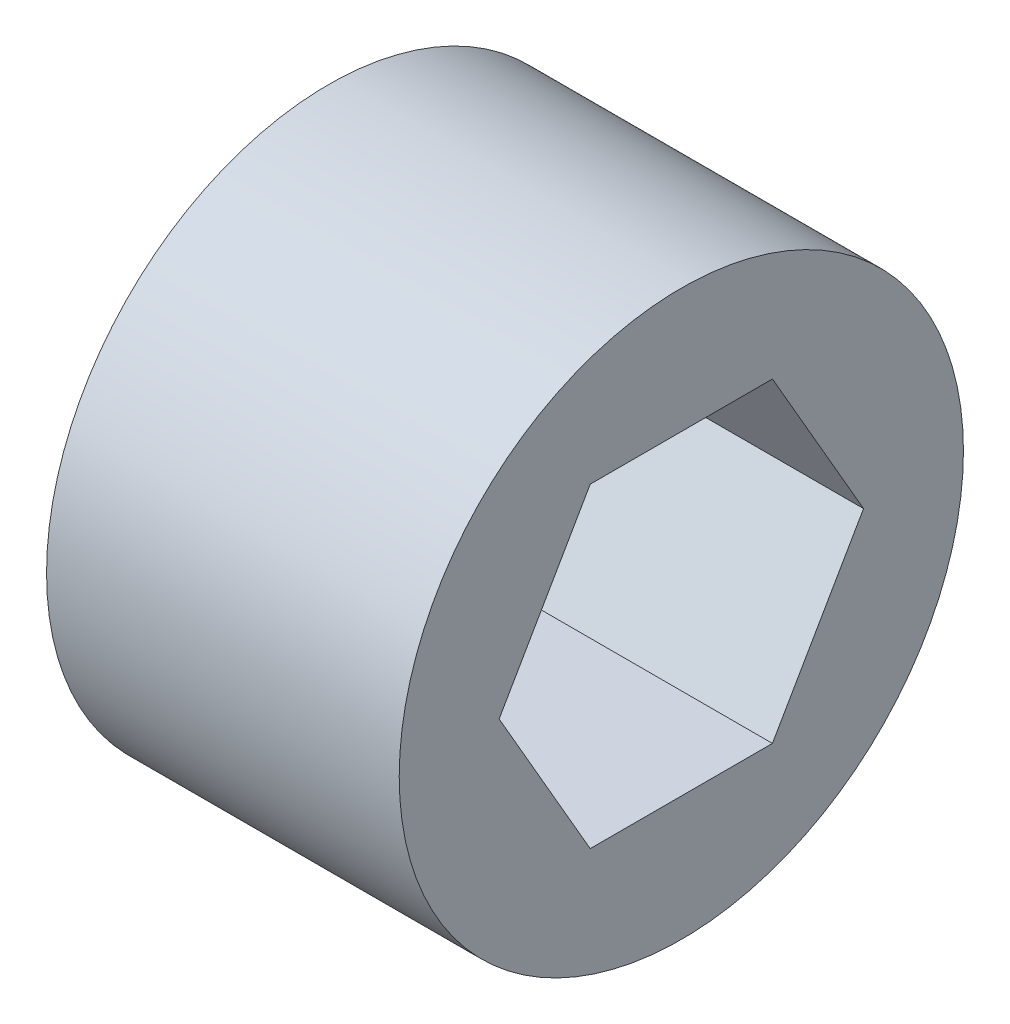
ISO-10303-21;
HEADER;
FILE_DESCRIPTION(('STEP AP214'),'2;1');
FILE_NAME('part.step','',(''),(''),'','','');
FILE_SCHEMA(('AUTOMOTIVE_DESIGN { 1 0 10303 214 1 1 1 1 }'));
ENDSEC;
DATA;
#1=APPLICATION_CONTEXT('core data for automotive mechanical design processes');
#2=APPLICATION_PROTOCOL_DEFINITION('international standard','automotive_design',2000,#1);
#3=PRODUCT_CONTEXT('',#1,'mechanical');
#4=PRODUCT('Part','Part','',(#3));
#5=PRODUCT_RELATED_PRODUCT_CATEGORY('part','',(#4));
#6=PRODUCT_DEFINITION_FORMATION('','',#4);
#7=PRODUCT_DEFINITION_CONTEXT('part definition',#1,'design');
#8=PRODUCT_DEFINITION('design','',#6,#7);
#9=PRODUCT_DEFINITION_SHAPE('','',#8);
#10=(LENGTH_UNIT() NAMED_UNIT(*) SI_UNIT(.MILLI.,.METRE.));
#11=(NAMED_UNIT(*) PLANE_ANGLE_UNIT() SI_UNIT($,.RADIAN.));
#12=(NAMED_UNIT(*) SI_UNIT($,.STERADIAN.) SOLID_ANGLE_UNIT());
#13=UNCERTAINTY_MEASURE_WITH_UNIT(LENGTH_MEASURE(1.E-05),#10,'distance_accuracy_value','');
#14=(GEOMETRIC_REPRESENTATION_CONTEXT(3) GLOBAL_UNCERTAINTY_ASSIGNED_CONTEXT((#13)) GLOBAL_UNIT_ASSIGNED_CONTEXT((#10,
#11,#12)) REPRESENTATION_CONTEXT('',''));
#15=CARTESIAN_POINT('',(0.,0.,0.));
#16=DIRECTION('',(0.,0.,1.));
#17=DIRECTION('',(1.,0.,0.));
#18=AXIS2_PLACEMENT_3D('',#15,#16,#17);
#19=CARTESIAN_POINT('',(43.895,10.675,6.85639999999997));
#20=DIRECTION('',(-1.,0.,0.));
#21=DIRECTION('',(0.,0.,1.));
#22=AXIS2_PLACEMENT_3D('',#19,#20,#21);
#23=PLANE('',#22);
#24=DIRECTION('',(0.,-0.866025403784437,0.500000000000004));
#25=VECTOR('',#24,1.);
#26=CARTESIAN_POINT('',(43.895,12.3797710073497,7.84064999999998));
#27=LINE('',#26,#25);
#28=CARTESIAN_POINT('',(43.895,12.3797710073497,7.84064999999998));
#29=VERTEX_POINT('',#28);
#30=CARTESIAN_POINT('',(43.895,10.675,8.82489999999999));
#31=VERTEX_POINT('',#30);
#32=EDGE_CURVE('E72',#29,#31,#27,.T.);
#33=ORIENTED_EDGE('',*,*,#32,.T.);
#34=DIRECTION('',(0.,-0.866025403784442,-0.499999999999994));
#35=VECTOR('',#34,1.);
#36=CARTESIAN_POINT('',(43.895,10.675,8.82489999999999));
#37=LINE('',#36,#35);
#38=CARTESIAN_POINT('',(43.895,8.97022899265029,7.84064999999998));
#39=VERTEX_POINT('',#38);
#40=EDGE_CURVE('E75',#31,#39,#37,.T.);
#41=ORIENTED_EDGE('',*,*,#40,.T.);
#42=DIRECTION('',(0.,0.,-1.));
#43=VECTOR('',#42,1.);
#44=CARTESIAN_POINT('',(43.895,8.97022899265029,7.84064999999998));
#45=LINE('',#44,#43);
#46=CARTESIAN_POINT('',(43.895,8.97022899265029,5.87214999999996));
#47=VERTEX_POINT('',#46);
#48=EDGE_CURVE('E93',#39,#47,#45,.T.);
#49=ORIENTED_EDGE('',*,*,#48,.T.);
#50=DIRECTION('',(0.,0.866025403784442,-0.499999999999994));
#51=VECTOR('',#50,1.);
#52=CARTESIAN_POINT('',(43.895,8.97022899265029,5.87214999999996));
#53=LINE('',#52,#51);
#54=CARTESIAN_POINT('',(43.895,10.675,4.88789999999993));
#55=VERTEX_POINT('',#54);
#56=EDGE_CURVE('E98',#47,#55,#53,.T.);
#57=ORIENTED_EDGE('',*,*,#56,.T.);
#58=DIRECTION('',(0.,0.866025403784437,0.500000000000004));
#59=VECTOR('',#58,1.);
#60=CARTESIAN_POINT('',(43.895,10.675,4.88789999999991));
#61=LINE('',#60,#59);
#62=CARTESIAN_POINT('',(43.895,12.3797710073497,5.87214999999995));
#63=VERTEX_POINT('',#62);
#64=EDGE_CURVE('E60',#55,#63,#61,.T.);
#65=ORIENTED_EDGE('',*,*,#64,.T.);
#66=DIRECTION('',(0.,0.,1.));
#67=VECTOR('',#66,1.);
#68=CARTESIAN_POINT('',(43.895,12.3797710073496,5.87214999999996));
#69=LINE('',#68,#67);
#70=EDGE_CURVE('E78',#63,#29,#69,.T.);
#71=ORIENTED_EDGE('',*,*,#70,.T.);
#72=EDGE_LOOP('',(#33,#41,#49,#57,#65,#71));
#73=FACE_BOUND('',#72,.T.);
#74=ADVANCED_FACE('F16',(#73),#23,.F.);
#75=CARTESIAN_POINT('',(46.435,12.3797710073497,7.84064999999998));
#76=DIRECTION('',(0.,0.500000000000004,0.866025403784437));
#77=DIRECTION('',(0.,-0.866025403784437,0.500000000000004));
#78=AXIS2_PLACEMENT_3D('',#75,#76,#77);
#79=PLANE('',#78);
#80=DIRECTION('',(1.,0.,0.));
#81=VECTOR('',#80,1.);
#82=CARTESIAN_POINT('',(46.435,12.3797710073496,7.84064999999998));
#83=LINE('',#82,#81);
#84=CARTESIAN_POINT('',(46.435,12.3797710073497,7.84064999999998));
#85=VERTEX_POINT('',#84);
#86=EDGE_CURVE('E53',#29,#85,#83,.T.);
#87=ORIENTED_EDGE('',*,*,#86,.T.);
#88=DIRECTION('',(0.,-0.86602540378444,0.499999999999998));
#89=VECTOR('',#88,1.);
#90=CARTESIAN_POINT('',(46.435,12.3797710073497,7.84064999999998));
#91=LINE('',#90,#89);
#92=CARTESIAN_POINT('',(46.435,10.675,8.82489999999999));
#93=VERTEX_POINT('',#92);
#94=EDGE_CURVE('E84',#85,#93,#91,.T.);
#95=ORIENTED_EDGE('',*,*,#94,.T.);
#96=DIRECTION('',(1.,0.,0.));
#97=VECTOR('',#96,1.);
#98=CARTESIAN_POINT('',(46.435,10.675,8.82489999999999));
#99=LINE('',#98,#97);
#100=EDGE_CURVE('E79',#93,#31,#99,.F.);
#101=ORIENTED_EDGE('',*,*,#100,.T.);
#102=ORIENTED_EDGE('',*,*,#32,.F.);
#103=EDGE_LOOP('',(#87,#95,#101,#102));
#104=FACE_BOUND('',#103,.T.);
#105=ADVANCED_FACE('F82',(#104),#79,.F.);
#106=CARTESIAN_POINT('',(46.435,10.675,8.82489999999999));
#107=DIRECTION('',(0.,-0.499999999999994,0.866025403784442));
#108=DIRECTION('',(0.,-0.866025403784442,-0.499999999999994));
#109=AXIS2_PLACEMENT_3D('',#106,#107,#108);
#110=PLANE('',#109);
#111=ORIENTED_EDGE('',*,*,#100,.F.);
#112=DIRECTION('',(0.,-0.86602540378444,-0.499999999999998));
#113=VECTOR('',#112,1.);
#114=CARTESIAN_POINT('',(46.435,10.675,8.82489999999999));
#115=LINE('',#114,#113);
#116=CARTESIAN_POINT('',(46.435,8.97022899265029,7.84064999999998));
#117=VERTEX_POINT('',#116);
#118=EDGE_CURVE('E117',#93,#117,#115,.T.);
#119=ORIENTED_EDGE('',*,*,#118,.T.);
#120=DIRECTION('',(1.,0.,0.));
#121=VECTOR('',#120,1.);
#122=CARTESIAN_POINT('',(46.435,8.97022899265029,7.84064999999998));
#123=LINE('',#122,#121);
#124=EDGE_CURVE('E90',#117,#39,#123,.F.);
#125=ORIENTED_EDGE('',*,*,#124,.T.);
#126=ORIENTED_EDGE('',*,*,#40,.F.);
#127=EDGE_LOOP('',(#111,#119,#125,#126));
#128=FACE_BOUND('',#127,.T.);
#129=ADVANCED_FACE('F88',(#128),#110,.F.);
#130=CARTESIAN_POINT('',(46.435,8.97022899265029,7.84064999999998));
#131=DIRECTION('',(0.,-1.,0.));
#132=DIRECTION('',(0.,0.,-1.));
#133=AXIS2_PLACEMENT_3D('',#130,#131,#132);
#134=PLANE('',#133);
#135=ORIENTED_EDGE('',*,*,#124,.F.);
#136=DIRECTION('',(0.,0.,1.));
#137=VECTOR('',#136,1.);
#138=CARTESIAN_POINT('',(46.435,8.97022899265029,6.85639999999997));
#139=LINE('',#138,#137);
#140=CARTESIAN_POINT('',(46.435,8.97022899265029,5.87214999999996));
#141=VERTEX_POINT('',#140);
#142=EDGE_CURVE('E115',#117,#141,#139,.F.);
#143=ORIENTED_EDGE('',*,*,#142,.T.);
#144=DIRECTION('',(1.,0.,0.));
#145=VECTOR('',#144,1.);
#146=CARTESIAN_POINT('',(46.435,8.97022899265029,5.87214999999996));
#147=LINE('',#146,#145);
#148=EDGE_CURVE('E96',#141,#47,#147,.F.);
#149=ORIENTED_EDGE('',*,*,#148,.T.);
#150=ORIENTED_EDGE('',*,*,#48,.F.);
#151=EDGE_LOOP('',(#135,#143,#149,#150));
#152=FACE_BOUND('',#151,.T.);
#153=ADVANCED_FACE('F122',(#152),#134,.F.);
#154=CARTESIAN_POINT('',(46.435,8.97022899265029,5.87214999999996));
#155=DIRECTION('',(0.,-0.499999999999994,-0.866025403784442));
#156=DIRECTION('',(0.,0.866025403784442,-0.499999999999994));
#157=AXIS2_PLACEMENT_3D('',#154,#155,#156);
#158=PLANE('',#157);
#159=ORIENTED_EDGE('',*,*,#148,.F.);
#160=DIRECTION('',(0.,0.86602540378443,-0.500000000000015));
#161=VECTOR('',#160,1.);
#162=CARTESIAN_POINT('',(46.435,8.97022899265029,5.87214999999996));
#163=LINE('',#162,#161);
#164=CARTESIAN_POINT('',(46.435,10.675,4.88789999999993));
#165=VERTEX_POINT('',#164);
#166=EDGE_CURVE('E113',#141,#165,#163,.T.);
#167=ORIENTED_EDGE('',*,*,#166,.T.);
#168=DIRECTION('',(1.,0.,0.));
#169=VECTOR('',#168,1.);
#170=CARTESIAN_POINT('',(46.435,10.675,4.88789999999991));
#171=LINE('',#170,#169);
#172=EDGE_CURVE('E100',#165,#55,#171,.F.);
#173=ORIENTED_EDGE('',*,*,#172,.T.);
#174=ORIENTED_EDGE('',*,*,#56,.F.);
#175=EDGE_LOOP('',(#159,#167,#173,#174));
#176=FACE_BOUND('',#175,.T.);
#177=ADVANCED_FACE('F129',(#176),#158,.F.);
#178=CARTESIAN_POINT('',(46.435,10.675,4.88789999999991));
#179=DIRECTION('',(0.,0.500000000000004,-0.866025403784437));
#180=DIRECTION('',(0.,0.866025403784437,0.500000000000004));
#181=AXIS2_PLACEMENT_3D('',#178,#179,#180);
#182=PLANE('',#181);
#183=ORIENTED_EDGE('',*,*,#172,.F.);
#184=DIRECTION('',(0.,0.866025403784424,0.500000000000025));
#185=VECTOR('',#184,1.);
#186=CARTESIAN_POINT('',(46.435,10.675,4.88789999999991));
#187=LINE('',#186,#185);
#188=CARTESIAN_POINT('',(46.435,12.3797710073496,5.87214999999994));
#189=VERTEX_POINT('',#188);
#190=EDGE_CURVE('E33',#165,#189,#187,.T.);
#191=ORIENTED_EDGE('',*,*,#190,.T.);
#192=DIRECTION('',(1.,0.,0.));
#193=VECTOR('',#192,1.);
#194=CARTESIAN_POINT('',(46.435,12.3797710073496,5.87214999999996));
#195=LINE('',#194,#193);
#196=EDGE_CURVE('E107',#189,#63,#195,.F.);
#197=ORIENTED_EDGE('',*,*,#196,.T.);
#198=ORIENTED_EDGE('',*,*,#64,.F.);
#199=EDGE_LOOP('',(#183,#191,#197,#198));
#200=FACE_BOUND('',#199,.T.);
#201=ADVANCED_FACE('F131',(#200),#182,.F.);
#202=CARTESIAN_POINT('',(46.435,12.3797710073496,5.87214999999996));
#203=DIRECTION('',(0.,1.,0.));
#204=DIRECTION('',(0.,0.,1.));
#205=AXIS2_PLACEMENT_3D('',#202,#203,#204);
#206=PLANE('',#205);
#207=ORIENTED_EDGE('',*,*,#196,.F.);
#208=DIRECTION('',(0.,0.,1.));
#209=VECTOR('',#208,1.);
#210=CARTESIAN_POINT('',(46.435,12.3797710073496,6.85639999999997));
#211=LINE('',#210,#209);
#212=EDGE_CURVE('E110',#189,#85,#211,.T.);
#213=ORIENTED_EDGE('',*,*,#212,.T.);
#214=ORIENTED_EDGE('',*,*,#86,.F.);
#215=ORIENTED_EDGE('',*,*,#70,.F.);
#216=EDGE_LOOP('',(#207,#213,#214,#215));
#217=FACE_BOUND('',#216,.T.);
#218=ADVANCED_FACE('F133',(#217),#206,.F.);
#219=CARTESIAN_POINT('',(46.435,10.9520909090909,6.85639999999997));
#220=DIRECTION('',(-1.,0.,0.));
#221=DIRECTION('',(0.,0.,1.));
#222=AXIS2_PLACEMENT_3D('',#219,#220,#221);
#223=PLANE('',#222);
#224=ORIENTED_EDGE('',*,*,#190,.F.);
#225=ORIENTED_EDGE('',*,*,#166,.F.);
#226=ORIENTED_EDGE('',*,*,#142,.F.);
#227=ORIENTED_EDGE('',*,*,#118,.F.);
#228=ORIENTED_EDGE('',*,*,#94,.F.);
#229=ORIENTED_EDGE('',*,*,#212,.F.);
#230=EDGE_LOOP('',(#224,#225,#226,#227,#228,#229));
#231=FACE_BOUND('',#230,.T.);
#232=CARTESIAN_POINT('',(46.435,10.675,6.85639999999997));
#233=DIRECTION('',(-1.,0.,0.));
#234=DIRECTION('',(0.,0.,1.));
#235=AXIS2_PLACEMENT_3D('',#232,#233,#234);
#236=CIRCLE('',#235,3.048);
#237=CARTESIAN_POINT('',(46.435,10.675,9.90439999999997));
#238=VERTEX_POINT('',#237);
#239=EDGE_CURVE('E20',#238,#238,#236,.T.);
#240=ORIENTED_EDGE('',*,*,#239,.F.);
#241=EDGE_LOOP('',(#240));
#242=FACE_BOUND('',#241,.T.);
#243=ADVANCED_FACE('F125',(#231,#242),#223,.F.);
#244=CARTESIAN_POINT('',(42.625,10.9520909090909,6.85639999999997));
#245=DIRECTION('',(-1.,0.,0.));
#246=DIRECTION('',(0.,0.,1.));
#247=AXIS2_PLACEMENT_3D('',#244,#245,#246);
#248=PLANE('',#247);
#249=CARTESIAN_POINT('',(42.625,10.675,6.85639999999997));
#250=DIRECTION('',(-1.,0.,0.));
#251=DIRECTION('',(0.,0.,1.));
#252=AXIS2_PLACEMENT_3D('',#249,#250,#251);
#253=CIRCLE('',#252,3.048);
#254=CARTESIAN_POINT('',(42.625,10.675,9.90439999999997));
#255=VERTEX_POINT('',#254);
#256=EDGE_CURVE('E11',#255,#255,#253,.F.);
#257=ORIENTED_EDGE('',*,*,#256,.F.);
#258=EDGE_LOOP('',(#257));
#259=FACE_BOUND('',#258,.T.);
#260=ADVANCED_FACE('F141',(#259),#248,.T.);
#261=CARTESIAN_POINT('',(46.435,10.675,6.85639999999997));
#262=DIRECTION('',(-1.,0.,0.));
#263=DIRECTION('',(0.,0.,1.));
#264=AXIS2_PLACEMENT_3D('',#261,#262,#263);
#265=CYLINDRICAL_SURFACE('',#264,3.048);
#266=ORIENTED_EDGE('',*,*,#239,.T.);
#267=EDGE_LOOP('',(#266));
#268=FACE_BOUND('',#267,.T.);
#269=ORIENTED_EDGE('',*,*,#256,.T.);
#270=EDGE_LOOP('',(#269));
#271=FACE_BOUND('',#270,.T.);
#272=ADVANCED_FACE('F18',(#268,#271),#265,.T.);
#273=CLOSED_SHELL('',(#74,#105,#129,#153,#177,#201,#218,#243,#260,#272));
#274=MANIFOLD_SOLID_BREP('B1',#273);
#275=ADVANCED_BREP_SHAPE_REPRESENTATION('',(#18,#274),#14);
#276=SHAPE_DEFINITION_REPRESENTATION(#9,#275);
ENDSEC;
END-ISO-10303-21;
